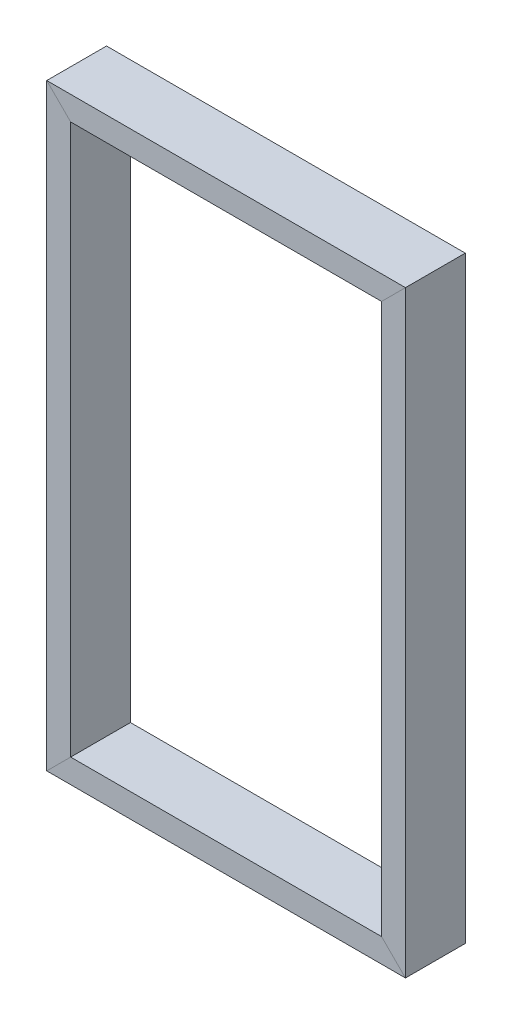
from build123d import *

# Parameters (mm, degrees)
LINEAR_AUSTRAGEN1_DEPTH = 25
LINEAR_AUSTRAGEN2_DEPTH = 25
KREISMUSTER1_COUNT      = 2


with BuildPart() as part:
    # Skizze1 → Linear austragen1 (new, symmetric)
    with BuildSketch(Plane.XY):
        Polygon((-150, 250), (-130, 230), (-130, -230), (-150, -250), align=None)
    extrude(amount=LINEAR_AUSTRAGEN1_DEPTH, both=True)


with BuildPart() as body_2:
    # Skizze2 → Linear austragen2 (new, symmetric)
    with BuildSketch(Plane.XY):
        Polygon((-130, 230), (-150, 250), (150, 250), (130, 230), align=None)
    extrude(amount=LINEAR_AUSTRAGEN2_DEPTH, both=True)


with BuildPart() as kreismuster1_1:
    # Kreismuster1: pattern copy
    add(body_2.part.rotate(Axis((0, 0, 0), (0, 0, 1)), 1 * 360 / KREISMUSTER1_COUNT))


with BuildPart() as kreismuster1_2:
    # Kreismuster1: pattern copy
    add(part.part.rotate(Axis((0, 0, 0), (0, 0, 1)), 1 * 360 / KREISMUSTER1_COUNT))


solid = Compound([part.part, body_2.part, kreismuster1_1.part, kreismuster1_2.part])
